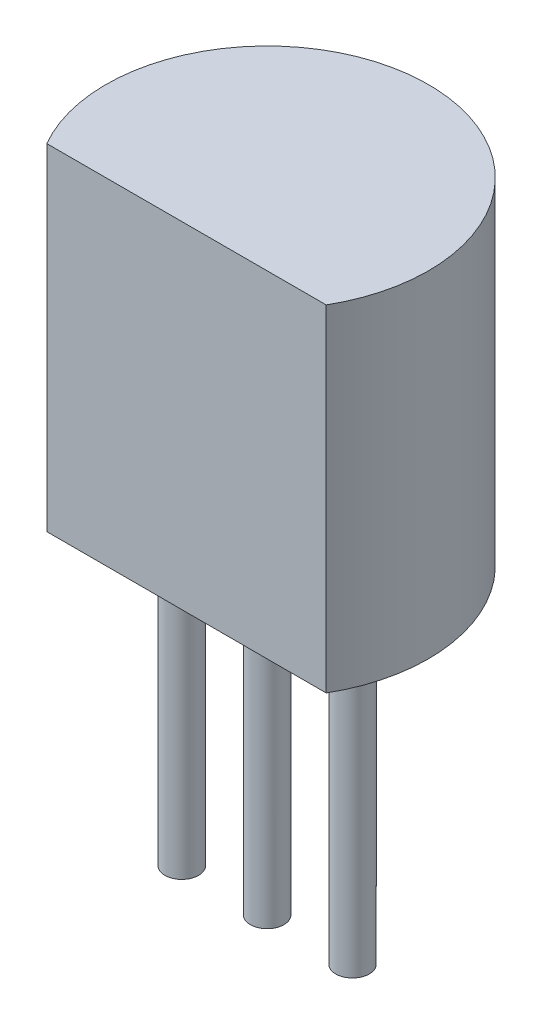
ISO-10303-21;
HEADER;
FILE_DESCRIPTION(('STEP AP214'),'2;1');
FILE_NAME('part.step','',(''),(''),'','','');
FILE_SCHEMA(('AUTOMOTIVE_DESIGN { 1 0 10303 214 1 1 1 1 }'));
ENDSEC;
DATA;
#1=APPLICATION_CONTEXT('core data for automotive mechanical design processes');
#2=APPLICATION_PROTOCOL_DEFINITION('international standard','automotive_design',2000,#1);
#3=PRODUCT_CONTEXT('',#1,'mechanical');
#4=PRODUCT('Part','Part','',(#3));
#5=PRODUCT_RELATED_PRODUCT_CATEGORY('part','',(#4));
#6=PRODUCT_DEFINITION_FORMATION('','',#4);
#7=PRODUCT_DEFINITION_CONTEXT('part definition',#1,'design');
#8=PRODUCT_DEFINITION('design','',#6,#7);
#9=PRODUCT_DEFINITION_SHAPE('','',#8);
#10=(LENGTH_UNIT() NAMED_UNIT(*) SI_UNIT(.MILLI.,.METRE.));
#11=(NAMED_UNIT(*) PLANE_ANGLE_UNIT() SI_UNIT($,.RADIAN.));
#12=(NAMED_UNIT(*) SI_UNIT($,.STERADIAN.) SOLID_ANGLE_UNIT());
#13=UNCERTAINTY_MEASURE_WITH_UNIT(LENGTH_MEASURE(1.E-05),#10,'distance_accuracy_value','');
#14=(GEOMETRIC_REPRESENTATION_CONTEXT(3) GLOBAL_UNCERTAINTY_ASSIGNED_CONTEXT((#13)) GLOBAL_UNIT_ASSIGNED_CONTEXT((#10,
#11,#12)) REPRESENTATION_CONTEXT('',''));
#15=CARTESIAN_POINT('',(0.,0.,0.));
#16=DIRECTION('',(0.,0.,1.));
#17=DIRECTION('',(1.,0.,0.));
#18=AXIS2_PLACEMENT_3D('',#15,#16,#17);
#19=CARTESIAN_POINT('',(0.,5.,0.));
#20=DIRECTION('',(0.,-1.,0.));
#21=DIRECTION('',(0.,0.,-1.));
#22=AXIS2_PLACEMENT_3D('',#19,#20,#21);
#23=CYLINDRICAL_SURFACE('',#22,2.4);
#24=CARTESIAN_POINT('',(0.,0.,0.));
#25=DIRECTION('',(0.,1.,0.));
#26=DIRECTION('',(0.,0.,1.));
#27=AXIS2_PLACEMENT_3D('',#24,#25,#26);
#28=CIRCLE('',#27,2.4);
#29=CARTESIAN_POINT('',(2.07846096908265,0.,1.2));
#30=VERTEX_POINT('',#29);
#31=CARTESIAN_POINT('',(-2.07846096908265,0.,1.2));
#32=VERTEX_POINT('',#31);
#33=EDGE_CURVE('E67',#30,#32,#28,.T.);
#34=ORIENTED_EDGE('',*,*,#33,.T.);
#35=DIRECTION('',(0.,-1.,0.));
#36=VECTOR('',#35,1.);
#37=CARTESIAN_POINT('',(-2.07846096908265,5.,1.2));
#38=LINE('',#37,#36);
#39=CARTESIAN_POINT('',(-2.07846096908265,5.,1.2));
#40=VERTEX_POINT('',#39);
#41=EDGE_CURVE('E64',#40,#32,#38,.T.);
#42=ORIENTED_EDGE('',*,*,#41,.F.);
#43=CARTESIAN_POINT('',(0.,5.,0.));
#44=DIRECTION('',(0.,1.,0.));
#45=DIRECTION('',(0.,0.,1.));
#46=AXIS2_PLACEMENT_3D('',#43,#44,#45);
#47=CIRCLE('',#46,2.4);
#48=CARTESIAN_POINT('',(2.07846096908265,5.,1.2));
#49=VERTEX_POINT('',#48);
#50=EDGE_CURVE('E66',#49,#40,#47,.T.);
#51=ORIENTED_EDGE('',*,*,#50,.F.);
#52=DIRECTION('',(0.,-1.,0.));
#53=VECTOR('',#52,1.);
#54=CARTESIAN_POINT('',(2.07846096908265,5.,1.2));
#55=LINE('',#54,#53);
#56=EDGE_CURVE('E61',#49,#30,#55,.T.);
#57=ORIENTED_EDGE('',*,*,#56,.T.);
#58=EDGE_LOOP('',(#34,#42,#51,#57));
#59=FACE_BOUND('',#58,.T.);
#60=ADVANCED_FACE('F33',(#59),#23,.T.);
#61=CARTESIAN_POINT('',(-2.07846096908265,5.,1.2));
#62=DIRECTION('',(0.,0.,-1.));
#63=DIRECTION('',(-1.,0.,0.));
#64=AXIS2_PLACEMENT_3D('',#61,#62,#63);
#65=PLANE('',#64);
#66=DIRECTION('',(1.,0.,0.));
#67=VECTOR('',#66,1.);
#68=CARTESIAN_POINT('',(-2.07846096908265,0.,1.2));
#69=LINE('',#68,#67);
#70=EDGE_CURVE('E56',#32,#30,#69,.T.);
#71=ORIENTED_EDGE('',*,*,#70,.T.);
#72=ORIENTED_EDGE('',*,*,#56,.F.);
#73=DIRECTION('',(1.,0.,0.));
#74=VECTOR('',#73,1.);
#75=CARTESIAN_POINT('',(-2.07846096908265,5.,1.2));
#76=LINE('',#75,#74);
#77=EDGE_CURVE('E48',#40,#49,#76,.T.);
#78=ORIENTED_EDGE('',*,*,#77,.F.);
#79=ORIENTED_EDGE('',*,*,#41,.T.);
#80=EDGE_LOOP('',(#71,#72,#78,#79));
#81=FACE_BOUND('',#80,.T.);
#82=ADVANCED_FACE('F60',(#81),#65,.F.);
#83=CARTESIAN_POINT('',(0.,5.,0.));
#84=DIRECTION('',(0.,1.,0.));
#85=DIRECTION('',(0.,0.,1.));
#86=AXIS2_PLACEMENT_3D('',#83,#84,#85);
#87=PLANE('',#86);
#88=ORIENTED_EDGE('',*,*,#50,.T.);
#89=ORIENTED_EDGE('',*,*,#77,.T.);
#90=EDGE_LOOP('',(#88,#89));
#91=FACE_BOUND('',#90,.T.);
#92=ADVANCED_FACE('F91',(#91),#87,.T.);
#93=CARTESIAN_POINT('',(0.,0.,0.));
#94=DIRECTION('',(0.,1.,0.));
#95=DIRECTION('',(0.,0.,1.));
#96=AXIS2_PLACEMENT_3D('',#93,#94,#95);
#97=PLANE('',#96);
#98=CARTESIAN_POINT('',(-1.27,0.,0.));
#99=DIRECTION('',(0.,1.,0.));
#100=DIRECTION('',(0.,0.,1.));
#101=AXIS2_PLACEMENT_3D('',#98,#99,#100);
#102=CIRCLE('',#101,0.25);
#103=CARTESIAN_POINT('',(-1.27,0.,0.25));
#104=VERTEX_POINT('',#103);
#105=EDGE_CURVE('E11',#104,#104,#102,.F.);
#106=ORIENTED_EDGE('',*,*,#105,.F.);
#107=EDGE_LOOP('',(#106));
#108=FACE_BOUND('',#107,.T.);
#109=CARTESIAN_POINT('',(1.27,0.,0.));
#110=DIRECTION('',(0.,1.,0.));
#111=DIRECTION('',(0.,0.,1.));
#112=AXIS2_PLACEMENT_3D('',#109,#110,#111);
#113=CIRCLE('',#112,0.25);
#114=CARTESIAN_POINT('',(1.27,0.,0.25));
#115=VERTEX_POINT('',#114);
#116=EDGE_CURVE('E41',#115,#115,#113,.F.);
#117=ORIENTED_EDGE('',*,*,#116,.F.);
#118=EDGE_LOOP('',(#117));
#119=FACE_BOUND('',#118,.T.);
#120=CARTESIAN_POINT('',(0.,0.,0.));
#121=DIRECTION('',(0.,1.,0.));
#122=DIRECTION('',(0.,0.,1.));
#123=AXIS2_PLACEMENT_3D('',#120,#121,#122);
#124=CIRCLE('',#123,0.25);
#125=CARTESIAN_POINT('',(0.,0.,0.25));
#126=VERTEX_POINT('',#125);
#127=EDGE_CURVE('E81',#126,#126,#124,.F.);
#128=ORIENTED_EDGE('',*,*,#127,.F.);
#129=EDGE_LOOP('',(#128));
#130=FACE_BOUND('',#129,.T.);
#131=ORIENTED_EDGE('',*,*,#33,.F.);
#132=ORIENTED_EDGE('',*,*,#70,.F.);
#133=EDGE_LOOP('',(#131,#132));
#134=FACE_BOUND('',#133,.T.);
#135=ADVANCED_FACE('F71',(#108,#119,#130,#134),#97,.F.);
#136=CARTESIAN_POINT('',(0.,-4.5,0.));
#137=DIRECTION('',(0.,1.,0.));
#138=DIRECTION('',(0.,0.,1.));
#139=AXIS2_PLACEMENT_3D('',#136,#137,#138);
#140=CYLINDRICAL_SURFACE('',#139,0.25);
#141=CARTESIAN_POINT('',(0.,-4.5,0.));
#142=DIRECTION('',(0.,-1.,0.));
#143=DIRECTION('',(0.,0.,-1.));
#144=AXIS2_PLACEMENT_3D('',#141,#142,#143);
#145=CIRCLE('',#144,0.25);
#146=CARTESIAN_POINT('',(0.,-4.5,-0.25));
#147=VERTEX_POINT('',#146);
#148=EDGE_CURVE('E72',#147,#147,#145,.T.);
#149=ORIENTED_EDGE('',*,*,#148,.F.);
#150=EDGE_LOOP('',(#149));
#151=FACE_BOUND('',#150,.T.);
#152=ORIENTED_EDGE('',*,*,#127,.T.);
#153=EDGE_LOOP('',(#152));
#154=FACE_BOUND('',#153,.T.);
#155=ADVANCED_FACE('F90',(#151,#154),#140,.T.);
#156=CARTESIAN_POINT('',(0.,-4.5,0.));
#157=DIRECTION('',(0.,-1.,0.));
#158=DIRECTION('',(0.,0.,-1.));
#159=AXIS2_PLACEMENT_3D('',#156,#157,#158);
#160=PLANE('',#159);
#161=ORIENTED_EDGE('',*,*,#148,.T.);
#162=EDGE_LOOP('',(#161));
#163=FACE_BOUND('',#162,.T.);
#164=ADVANCED_FACE('F97',(#163),#160,.T.);
#165=CARTESIAN_POINT('',(1.27,-4.5,0.));
#166=DIRECTION('',(0.,1.,0.));
#167=DIRECTION('',(0.,0.,1.));
#168=AXIS2_PLACEMENT_3D('',#165,#166,#167);
#169=CYLINDRICAL_SURFACE('',#168,0.25);
#170=CARTESIAN_POINT('',(1.27,-4.5,0.));
#171=DIRECTION('',(0.,-1.,0.));
#172=DIRECTION('',(0.,0.,-1.));
#173=AXIS2_PLACEMENT_3D('',#170,#171,#172);
#174=CIRCLE('',#173,0.25);
#175=CARTESIAN_POINT('',(1.27,-4.5,-0.25));
#176=VERTEX_POINT('',#175);
#177=EDGE_CURVE('E75',#176,#176,#174,.T.);
#178=ORIENTED_EDGE('',*,*,#177,.F.);
#179=EDGE_LOOP('',(#178));
#180=FACE_BOUND('',#179,.T.);
#181=ORIENTED_EDGE('',*,*,#116,.T.);
#182=EDGE_LOOP('',(#181));
#183=FACE_BOUND('',#182,.T.);
#184=ADVANCED_FACE('F86',(#180,#183),#169,.T.);
#185=CARTESIAN_POINT('',(1.27,-4.5,0.));
#186=DIRECTION('',(0.,-1.,0.));
#187=DIRECTION('',(0.,0.,-1.));
#188=AXIS2_PLACEMENT_3D('',#185,#186,#187);
#189=PLANE('',#188);
#190=ORIENTED_EDGE('',*,*,#177,.T.);
#191=EDGE_LOOP('',(#190));
#192=FACE_BOUND('',#191,.T.);
#193=ADVANCED_FACE('F128',(#192),#189,.T.);
#194=CARTESIAN_POINT('',(-1.27,-4.5,0.));
#195=DIRECTION('',(0.,1.,0.));
#196=DIRECTION('',(0.,0.,1.));
#197=AXIS2_PLACEMENT_3D('',#194,#195,#196);
#198=CYLINDRICAL_SURFACE('',#197,0.25);
#199=CARTESIAN_POINT('',(-1.27,-4.5,0.));
#200=DIRECTION('',(0.,-1.,0.));
#201=DIRECTION('',(0.,0.,1.));
#202=AXIS2_PLACEMENT_3D('',#199,#200,#201);
#203=CIRCLE('',#202,0.25);
#204=CARTESIAN_POINT('',(-1.27,-4.5,0.25));
#205=VERTEX_POINT('',#204);
#206=EDGE_CURVE('E119',#205,#205,#203,.T.);
#207=ORIENTED_EDGE('',*,*,#206,.F.);
#208=EDGE_LOOP('',(#207));
#209=FACE_BOUND('',#208,.T.);
#210=ORIENTED_EDGE('',*,*,#105,.T.);
#211=EDGE_LOOP('',(#210));
#212=FACE_BOUND('',#211,.T.);
#213=ADVANCED_FACE('F125',(#209,#212),#198,.T.);
#214=CARTESIAN_POINT('',(-1.27,-4.5,0.));
#215=DIRECTION('',(0.,1.,0.));
#216=DIRECTION('',(0.,0.,1.));
#217=AXIS2_PLACEMENT_3D('',#214,#215,#216);
#218=PLANE('',#217);
#219=ORIENTED_EDGE('',*,*,#206,.T.);
#220=EDGE_LOOP('',(#219));
#221=FACE_BOUND('',#220,.T.);
#222=ADVANCED_FACE('F123',(#221),#218,.F.);
#223=CLOSED_SHELL('',(#60,#82,#92,#135,#155,#164,#184,#193,#213,#222));
#224=MANIFOLD_SOLID_BREP('B2',#223);
#225=ADVANCED_BREP_SHAPE_REPRESENTATION('',(#18,#224),#14);
#226=SHAPE_DEFINITION_REPRESENTATION(#9,#225);
ENDSEC;
END-ISO-10303-21;
